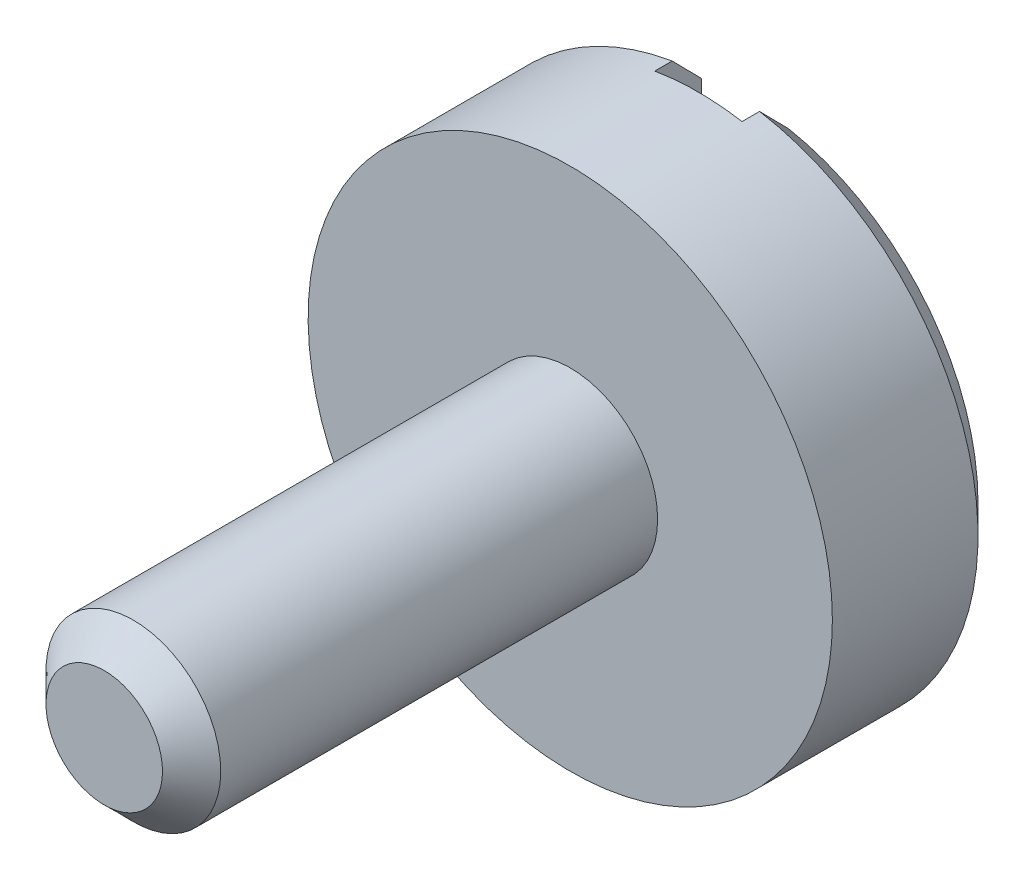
from build123d import *

# Parameters (mm, degrees)
ESQUISSE1_R             = 4.5
EXTRUSION1_DEPTH        = 3
ESQUISSE2_R             = 1.5
EXTRUSION2_DEPTH        = 8
CHANFREIN1_SIZE         = 0.5
ESQUISSE3_W             = 1.5
ESQUISSE3_H             = 9.808
ENL_V_MAT_EXTRU_1_DEPTH = 0.8
CHANFREIN2_SIZE         = 0.5


with BuildPart() as part:
    # Esquisse1 → Extrusion1 (new body)
    with BuildSketch(Plane.XY):
        Circle(ESQUISSE1_R)
    extrude(amount=EXTRUSION1_DEPTH)

    # Esquisse2 → Extrusion2 (add)
    with BuildSketch(Plane.XY.offset(3)):
        Circle(ESQUISSE2_R)
    extrude(amount=EXTRUSION2_DEPTH)

    # Chanfrein1
    chanfrein1_edges = [part.edges().sort_by_distance(p)[0] for p in [
        (-4.5, 0, 0),
    ]]
    chamfer(chanfrein1_edges, length=CHANFREIN1_SIZE)

    # Esquisse3 → Enl_v. mat.-Extru.1 (cut)
    with BuildSketch(Plane(origin=(0, 0, 0), x_dir=(-1, 0, 0), z_dir=(0, 0, -1))):
        with Locations((0, -0.08)):
            Rectangle(ESQUISSE3_W, ESQUISSE3_H)
    extrude(amount=-ENL_V_MAT_EXTRU_1_DEPTH, mode=Mode.SUBTRACT)

    # Chanfrein2
    chanfrein2_edges = [part.edges().sort_by_distance(p)[0] for p in [
        (-1.5, 0, 11),
    ]]
    chamfer(chanfrein2_edges, length=CHANFREIN2_SIZE)


solid = part.part
